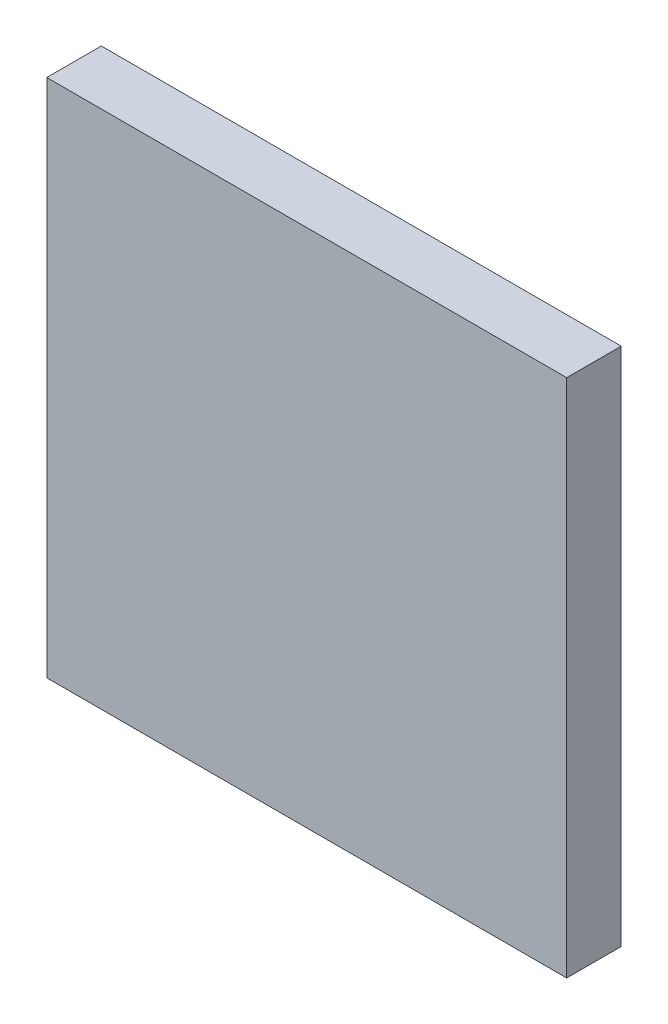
ISO-10303-21;
HEADER;
FILE_DESCRIPTION(('STEP AP214'),'2;1');
FILE_NAME('part.step','',(''),(''),'','','');
FILE_SCHEMA(('AUTOMOTIVE_DESIGN { 1 0 10303 214 1 1 1 1 }'));
ENDSEC;
DATA;
#1=APPLICATION_CONTEXT('core data for automotive mechanical design processes');
#2=APPLICATION_PROTOCOL_DEFINITION('international standard','automotive_design',2000,#1);
#3=PRODUCT_CONTEXT('',#1,'mechanical');
#4=PRODUCT('Part','Part','',(#3));
#5=PRODUCT_RELATED_PRODUCT_CATEGORY('part','',(#4));
#6=PRODUCT_DEFINITION_FORMATION('','',#4);
#7=PRODUCT_DEFINITION_CONTEXT('part definition',#1,'design');
#8=PRODUCT_DEFINITION('design','',#6,#7);
#9=PRODUCT_DEFINITION_SHAPE('','',#8);
#10=(LENGTH_UNIT() NAMED_UNIT(*) SI_UNIT(.MILLI.,.METRE.));
#11=(NAMED_UNIT(*) PLANE_ANGLE_UNIT() SI_UNIT($,.RADIAN.));
#12=(NAMED_UNIT(*) SI_UNIT($,.STERADIAN.) SOLID_ANGLE_UNIT());
#13=UNCERTAINTY_MEASURE_WITH_UNIT(LENGTH_MEASURE(1.E-05),#10,'distance_accuracy_value','');
#14=(GEOMETRIC_REPRESENTATION_CONTEXT(3) GLOBAL_UNCERTAINTY_ASSIGNED_CONTEXT((#13)) GLOBAL_UNIT_ASSIGNED_CONTEXT((#10,
#11,#12)) REPRESENTATION_CONTEXT('',''));
#15=CARTESIAN_POINT('',(0.,0.,0.));
#16=DIRECTION('',(0.,0.,1.));
#17=DIRECTION('',(1.,0.,0.));
#18=AXIS2_PLACEMENT_3D('',#15,#16,#17);
#19=CARTESIAN_POINT('',(-4.04999987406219,4.04999916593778,0.04999990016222));
#20=DIRECTION('',(-8.74227765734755E-08,0.999999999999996,0.));
#21=DIRECTION('',(0.999999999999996,8.74227765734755E-08,0.));
#22=AXIS2_PLACEMENT_3D('',#19,#20,#21);
#23=PLANE('',#22);
#24=DIRECTION('',(0.,0.,1.));
#25=VECTOR('',#24,1.);
#26=CARTESIAN_POINT('',(-4.04999987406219,4.04999916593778,0.04999990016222));
#27=LINE('',#26,#25);
#28=CARTESIAN_POINT('',(-4.04999987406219,4.04999916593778,0.04999990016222));
#29=VERTEX_POINT('',#28);
#30=CARTESIAN_POINT('',(-4.04999987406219,4.04999916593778,0.90000074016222));
#31=VERTEX_POINT('',#30);
#32=EDGE_CURVE('E11',#29,#31,#27,.T.);
#33=ORIENTED_EDGE('',*,*,#32,.T.);
#34=DIRECTION('',(0.999999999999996,8.74227765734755E-08,0.));
#35=VECTOR('',#34,1.);
#36=CARTESIAN_POINT('',(-4.04999987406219,4.04999916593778,0.90000074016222));
#37=LINE('',#36,#35);
#38=CARTESIAN_POINT('',(4.04999916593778,4.04999987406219,0.90000074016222));
#39=VERTEX_POINT('',#38);
#40=EDGE_CURVE('E24',#31,#39,#37,.T.);
#41=ORIENTED_EDGE('',*,*,#40,.T.);
#42=DIRECTION('',(0.,0.,1.));
#43=VECTOR('',#42,1.);
#44=CARTESIAN_POINT('',(4.04999916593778,4.04999987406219,0.04999990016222));
#45=LINE('',#44,#43);
#46=CARTESIAN_POINT('',(4.04999916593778,4.04999987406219,0.04999990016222));
#47=VERTEX_POINT('',#46);
#48=EDGE_CURVE('E85',#47,#39,#45,.T.);
#49=ORIENTED_EDGE('',*,*,#48,.F.);
#50=DIRECTION('',(0.999999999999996,8.74227765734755E-08,0.));
#51=VECTOR('',#50,1.);
#52=CARTESIAN_POINT('',(-4.04999987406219,4.04999916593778,0.04999990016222));
#53=LINE('',#52,#51);
#54=EDGE_CURVE('E83',#29,#47,#53,.T.);
#55=ORIENTED_EDGE('',*,*,#54,.F.);
#56=EDGE_LOOP('',(#33,#41,#49,#55));
#57=FACE_BOUND('',#56,.T.);
#58=ADVANCED_FACE('F17',(#57),#23,.T.);
#59=CARTESIAN_POINT('',(4.04999916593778,4.04999987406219,0.04999990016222));
#60=DIRECTION('',(0.999999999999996,8.74227765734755E-08,0.));
#61=DIRECTION('',(8.74227765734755E-08,-0.999999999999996,0.));
#62=AXIS2_PLACEMENT_3D('',#59,#60,#61);
#63=PLANE('',#62);
#64=ORIENTED_EDGE('',*,*,#48,.T.);
#65=DIRECTION('',(8.74227765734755E-08,-0.999999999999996,0.));
#66=VECTOR('',#65,1.);
#67=CARTESIAN_POINT('',(4.04999916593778,4.04999987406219,0.90000074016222));
#68=LINE('',#67,#66);
#69=CARTESIAN_POINT('',(4.04999987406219,-4.04999916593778,0.90000074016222));
#70=VERTEX_POINT('',#69);
#71=EDGE_CURVE('E81',#39,#70,#68,.T.);
#72=ORIENTED_EDGE('',*,*,#71,.T.);
#73=DIRECTION('',(0.,0.,1.));
#74=VECTOR('',#73,1.);
#75=CARTESIAN_POINT('',(4.04999987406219,-4.04999916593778,0.04999990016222));
#76=LINE('',#75,#74);
#77=CARTESIAN_POINT('',(4.04999987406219,-4.04999916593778,0.04999990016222));
#78=VERTEX_POINT('',#77);
#79=EDGE_CURVE('E79',#78,#70,#76,.T.);
#80=ORIENTED_EDGE('',*,*,#79,.F.);
#81=DIRECTION('',(8.74227765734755E-08,-0.999999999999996,0.));
#82=VECTOR('',#81,1.);
#83=CARTESIAN_POINT('',(4.04999916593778,4.04999987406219,0.04999990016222));
#84=LINE('',#83,#82);
#85=EDGE_CURVE('E61',#47,#78,#84,.T.);
#86=ORIENTED_EDGE('',*,*,#85,.F.);
#87=EDGE_LOOP('',(#64,#72,#80,#86));
#88=FACE_BOUND('',#87,.T.);
#89=ADVANCED_FACE('F90',(#88),#63,.T.);
#90=CARTESIAN_POINT('',(4.04999987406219,-4.04999916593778,0.04999990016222));
#91=DIRECTION('',(8.74227765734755E-08,-0.999999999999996,0.));
#92=DIRECTION('',(-0.999999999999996,-8.74227765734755E-08,0.));
#93=AXIS2_PLACEMENT_3D('',#90,#91,#92);
#94=PLANE('',#93);
#95=ORIENTED_EDGE('',*,*,#79,.T.);
#96=DIRECTION('',(-0.999999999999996,-8.74227765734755E-08,0.));
#97=VECTOR('',#96,1.);
#98=CARTESIAN_POINT('',(4.04999987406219,-4.04999916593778,0.90000074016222));
#99=LINE('',#98,#97);
#100=CARTESIAN_POINT('',(-4.04999916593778,-4.04999987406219,0.90000074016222));
#101=VERTEX_POINT('',#100);
#102=EDGE_CURVE('E70',#70,#101,#99,.T.);
#103=ORIENTED_EDGE('',*,*,#102,.T.);
#104=DIRECTION('',(0.,0.,1.));
#105=VECTOR('',#104,1.);
#106=CARTESIAN_POINT('',(-4.04999916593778,-4.04999987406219,0.04999990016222));
#107=LINE('',#106,#105);
#108=CARTESIAN_POINT('',(-4.04999916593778,-4.04999987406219,0.04999990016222));
#109=VERTEX_POINT('',#108);
#110=EDGE_CURVE('E64',#109,#101,#107,.T.);
#111=ORIENTED_EDGE('',*,*,#110,.F.);
#112=DIRECTION('',(-0.999999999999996,-8.74227765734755E-08,0.));
#113=VECTOR('',#112,1.);
#114=CARTESIAN_POINT('',(4.04999987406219,-4.04999916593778,0.04999990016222));
#115=LINE('',#114,#113);
#116=EDGE_CURVE('E55',#78,#109,#115,.T.);
#117=ORIENTED_EDGE('',*,*,#116,.F.);
#118=EDGE_LOOP('',(#95,#103,#111,#117));
#119=FACE_BOUND('',#118,.T.);
#120=ADVANCED_FACE('F68',(#119),#94,.T.);
#121=CARTESIAN_POINT('',(-4.04999916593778,-4.04999987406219,0.04999990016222));
#122=DIRECTION('',(-0.999999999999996,-8.74227765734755E-08,0.));
#123=DIRECTION('',(-8.74227765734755E-08,0.999999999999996,0.));
#124=AXIS2_PLACEMENT_3D('',#121,#122,#123);
#125=PLANE('',#124);
#126=ORIENTED_EDGE('',*,*,#110,.T.);
#127=DIRECTION('',(-8.74227765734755E-08,0.999999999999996,0.));
#128=VECTOR('',#127,1.);
#129=CARTESIAN_POINT('',(-4.04999916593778,-4.04999987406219,0.90000074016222));
#130=LINE('',#129,#128);
#131=EDGE_CURVE('E65',#101,#31,#130,.T.);
#132=ORIENTED_EDGE('',*,*,#131,.T.);
#133=ORIENTED_EDGE('',*,*,#32,.F.);
#134=DIRECTION('',(-8.74227765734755E-08,0.999999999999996,0.));
#135=VECTOR('',#134,1.);
#136=CARTESIAN_POINT('',(-4.04999916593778,-4.04999987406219,0.04999990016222));
#137=LINE('',#136,#135);
#138=EDGE_CURVE('E59',#109,#29,#137,.T.);
#139=ORIENTED_EDGE('',*,*,#138,.F.);
#140=EDGE_LOOP('',(#126,#132,#133,#139));
#141=FACE_BOUND('',#140,.T.);
#142=ADVANCED_FACE('F73',(#141),#125,.T.);
#143=CARTESIAN_POINT('',(-4.04999987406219,4.04999916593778,0.04999990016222));
#144=DIRECTION('',(0.,0.,1.));
#145=DIRECTION('',(-0.999999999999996,-8.74227765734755E-08,0.));
#146=AXIS2_PLACEMENT_3D('',#143,#144,#145);
#147=PLANE('',#146);
#148=ORIENTED_EDGE('',*,*,#54,.T.);
#149=ORIENTED_EDGE('',*,*,#85,.T.);
#150=ORIENTED_EDGE('',*,*,#116,.T.);
#151=ORIENTED_EDGE('',*,*,#138,.T.);
#152=EDGE_LOOP('',(#148,#149,#150,#151));
#153=FACE_BOUND('',#152,.T.);
#154=ADVANCED_FACE('F58',(#153),#147,.F.);
#155=CARTESIAN_POINT('',(-4.04999987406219,4.04999916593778,0.90000074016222));
#156=DIRECTION('',(0.,0.,1.));
#157=DIRECTION('',(-0.999999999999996,-8.74227765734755E-08,0.));
#158=AXIS2_PLACEMENT_3D('',#155,#156,#157);
#159=PLANE('',#158);
#160=ORIENTED_EDGE('',*,*,#131,.F.);
#161=ORIENTED_EDGE('',*,*,#102,.F.);
#162=ORIENTED_EDGE('',*,*,#71,.F.);
#163=ORIENTED_EDGE('',*,*,#40,.F.);
#164=EDGE_LOOP('',(#160,#161,#162,#163));
#165=FACE_BOUND('',#164,.T.);
#166=ADVANCED_FACE('F91',(#165),#159,.T.);
#167=CLOSED_SHELL('',(#58,#89,#120,#142,#154,#166));
#168=MANIFOLD_SOLID_BREP('B1',#167);
#169=ADVANCED_BREP_SHAPE_REPRESENTATION('',(#18,#168),#14);
#170=SHAPE_DEFINITION_REPRESENTATION(#9,#169);
ENDSEC;
END-ISO-10303-21;
